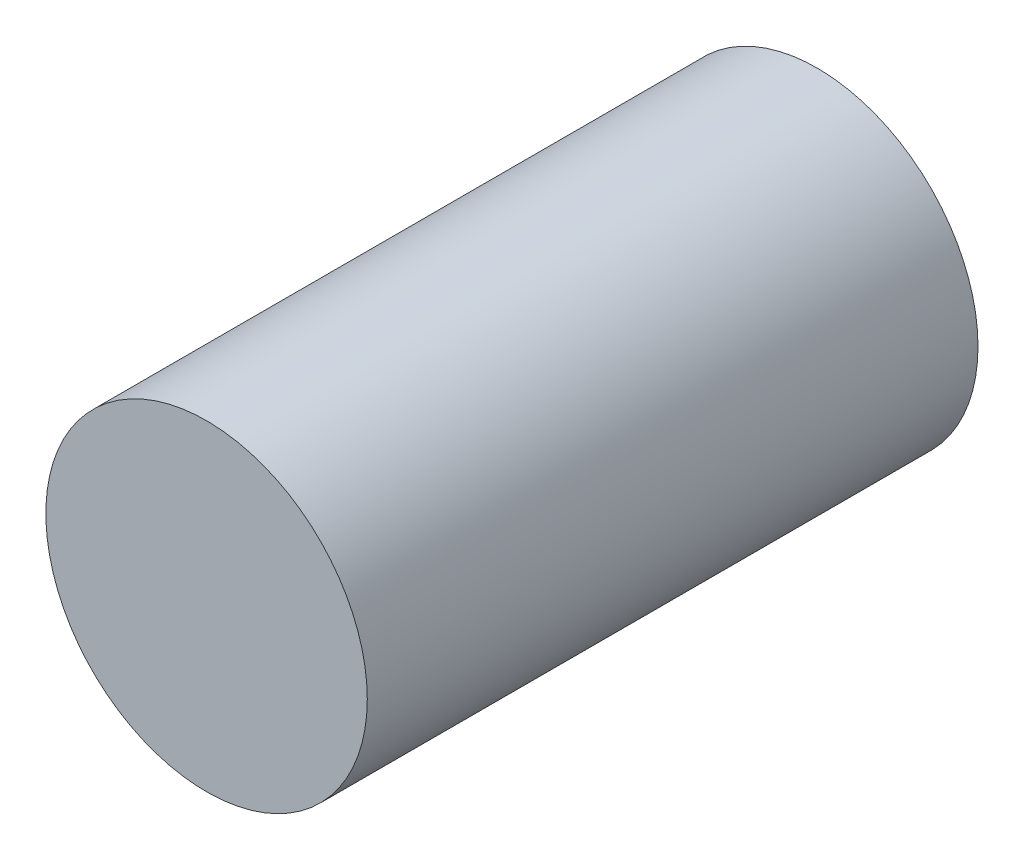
from build123d import *

# Parameters (mm, degrees)
SKETCH1_R           = 25
BOSS_EXTRUDE1_DEPTH = 95


with BuildPart() as part:
    # Sketch1 → Boss-Extrude1 (new body)
    with BuildSketch(Plane.XY):
        Circle(SKETCH1_R)
    extrude(amount=BOSS_EXTRUDE1_DEPTH)


solid = part.part
